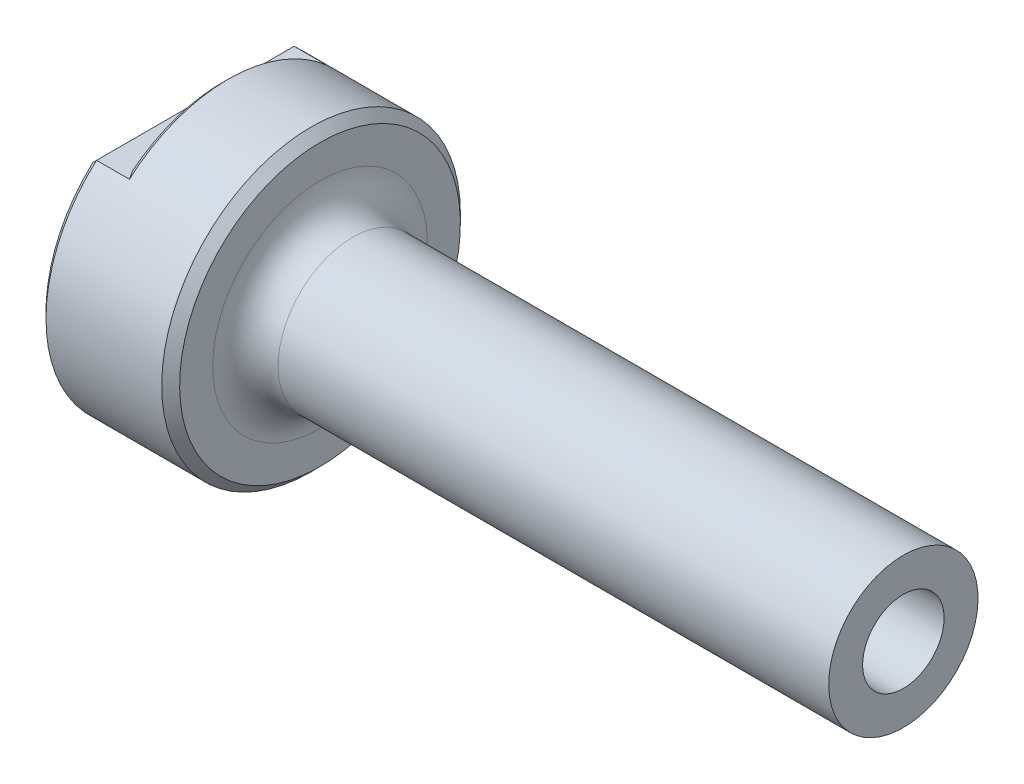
from build123d import *

# Parameters (mm, degrees)
SKETCH1_R           = 25.4
BOSS_EXTRUDE1_DEPTH = 60.721875
SKETCH3_W           = 50.8
SKETCH3_H           = 6.35
CUT_EXTRUDE1_DEPTH  = 5.588
SKETCH5_W           = 99.21875
SKETCH5_H           = 12.7
FILLET1_R           = 5.55625
CHAMFER1_SIZE       = 1.524
CHAMFER2_SIZE       = 1.016


with BuildPart() as part:
    # Sketch1 → Boss-Extrude1 (new, symmetric)
    with BuildSketch(Plane(origin=(0, 0, 0), x_dir=(0, 0, -1), z_dir=(1, 0, 0))):
        with Locations(Location((0, 0, 0), (0, 0, 180))):
            Circle(SKETCH1_R)
    extrude(amount=BOSS_EXTRUDE1_DEPTH, both=True)

    # Sketch3 → Cut-Extrude1 (cut)
    with BuildSketch(Plane.ZY.offset(60.721875)):
        with Locations((0, 22.225)):
            Rectangle(SKETCH3_W, SKETCH3_H)
    extrude(amount=-CUT_EXTRUDE1_DEPTH, mode=Mode.SUBTRACT)

    # Sketch5 → Cut-Revolve1 (revolve, cut)
    with BuildSketch(Plane.XY, mode=Mode.PRIVATE) as cut_revolve1_sk:
        with Locations((11.1125, -19.05)):
            Rectangle(SKETCH5_W, SKETCH5_H)
    revolve(cut_revolve1_sk.sketch.rotate(Axis((60.721875, 0, 0), (-1, 0, 0)), 138.590377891), axis=Axis((60.721875, 0, 0), (-1, 0, 0)), mode=Mode.SUBTRACT)

    # Sketch6 → Cut-Revolve2 (revolve, cut)
    with BuildSketch(Plane.XY):
        with BuildLine():
            Line((-56.099075, 0), (-60.721875, 0))
            Line((-60.721875, 0), (-60.721875, 9.800451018))
            ThreePointArc((-60.721875, 9.800451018), (-57.312769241, 5.418005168), (-56.099075, 0))
        make_face()
    revolve(axis=Axis((60.721875, 0, 0), (-1, 0, 0)), mode=Mode.SUBTRACT)

    # Sketch7 → Cut-Revolve3 (revolve, cut)
    with BuildSketch(Plane.XY):
        Polygon((-56.872997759, 4.365625), (60.721875, 6.931554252), (60.721875, 0), (-56.872997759, 0), align=None)
    revolve(axis=Axis((60.721875, 0, 0), (-1, 0, 0)), mode=Mode.SUBTRACT)

    # Fillet1
    fillet1_edges = [part.edges().sort_by_distance(p)[0] for p in [
        (-38.496875, -9.525, -8.400260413),
    ]]
    fillet(fillet1_edges, radius=FILLET1_R)

    # Chamfer1
    chamfer1_edges = [part.edges().sort_by_distance(p)[0] for p in [
        (-38.496875, 0, -25.4),
    ]]
    chamfer(chamfer1_edges, length=CHAMFER1_SIZE)

    # Chamfer2
    chamfer2_edges = [part.edges().sort_by_distance(p)[0] for p in [
        (-60.721875, -23.150520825, -10.450520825),
        (-60.721875, 19.05, 0),
        (-55.133875, 25.4, 0),
    ]]
    chamfer(chamfer2_edges, length=CHAMFER2_SIZE)


solid = part.part
